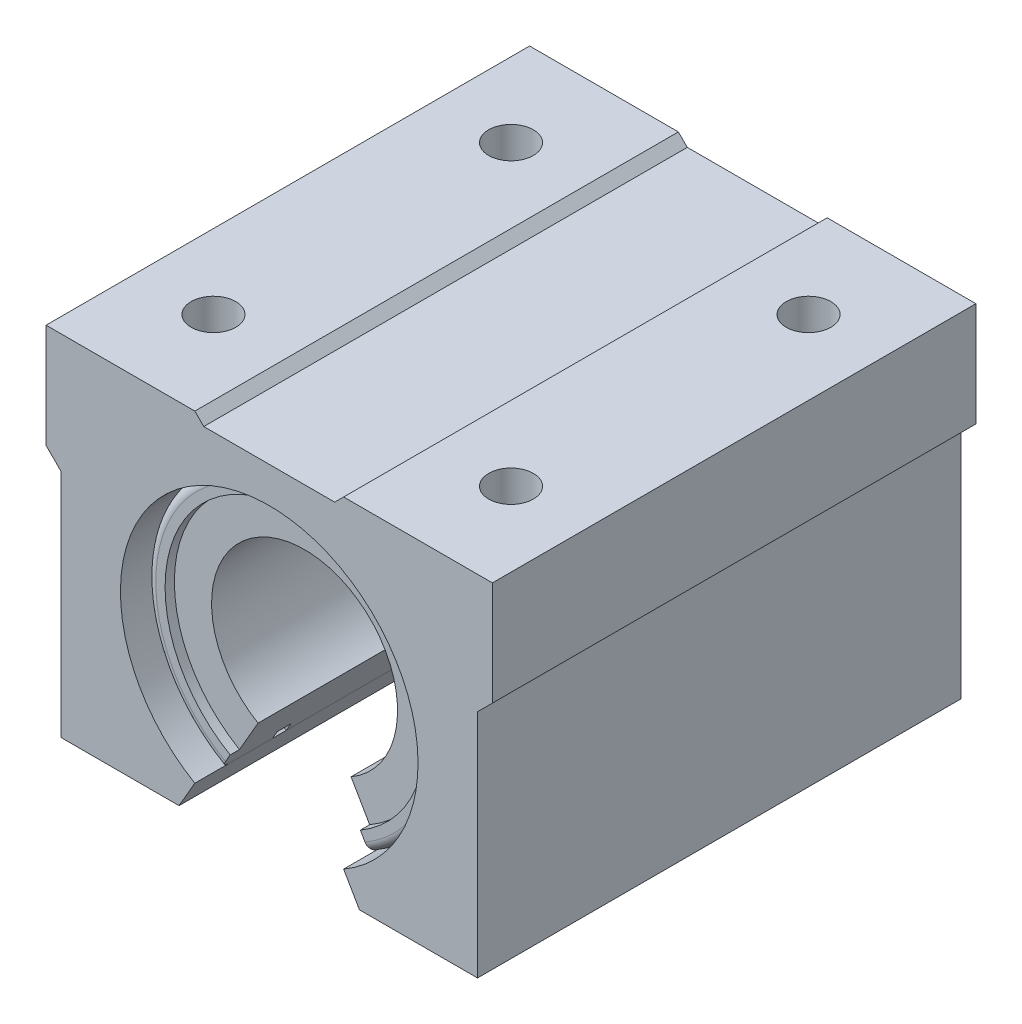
ISO-10303-21;
HEADER;
FILE_DESCRIPTION(('STEP AP214'),'2;1');
FILE_NAME('part.step','',(''),(''),'','','');
FILE_SCHEMA(('AUTOMOTIVE_DESIGN { 1 0 10303 214 1 1 1 1 }'));
ENDSEC;
DATA;
#1=APPLICATION_CONTEXT('core data for automotive mechanical design processes');
#2=APPLICATION_PROTOCOL_DEFINITION('international standard','automotive_design',2000,#1);
#3=PRODUCT_CONTEXT('',#1,'mechanical');
#4=PRODUCT('Part','Part','',(#3));
#5=PRODUCT_RELATED_PRODUCT_CATEGORY('part','',(#4));
#6=PRODUCT_DEFINITION_FORMATION('','',#4);
#7=PRODUCT_DEFINITION_CONTEXT('part definition',#1,'design');
#8=PRODUCT_DEFINITION('design','',#6,#7);
#9=PRODUCT_DEFINITION_SHAPE('','',#8);
#10=(LENGTH_UNIT() NAMED_UNIT(*) SI_UNIT(.MILLI.,.METRE.));
#11=(NAMED_UNIT(*) PLANE_ANGLE_UNIT() SI_UNIT($,.RADIAN.));
#12=(NAMED_UNIT(*) SI_UNIT($,.STERADIAN.) SOLID_ANGLE_UNIT());
#13=UNCERTAINTY_MEASURE_WITH_UNIT(LENGTH_MEASURE(1.E-05),#10,'distance_accuracy_value','');
#14=(GEOMETRIC_REPRESENTATION_CONTEXT(3) GLOBAL_UNCERTAINTY_ASSIGNED_CONTEXT((#13)) GLOBAL_UNIT_ASSIGNED_CONTEXT((#10,
#11,#12)) REPRESENTATION_CONTEXT('',''));
#15=CARTESIAN_POINT('',(0.,0.,0.));
#16=DIRECTION('',(0.,0.,1.));
#17=DIRECTION('',(1.,0.,0.));
#18=AXIS2_PLACEMENT_3D('',#15,#16,#17);
#19=CARTESIAN_POINT('',(0.,0.,29.));
#20=DIRECTION('',(0.,0.,-1.));
#21=DIRECTION('',(-1.,0.,0.));
#22=AXIS2_PLACEMENT_3D('',#19,#20,#21);
#23=CYLINDRICAL_SURFACE('',#22,12.5);
#24=DIRECTION('',(0.,0.,-1.));
#25=VECTOR('',#24,1.);
#26=CARTESIAN_POINT('',(6.25000000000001,-10.8253175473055,29.));
#27=LINE('',#26,#25);
#28=CARTESIAN_POINT('',(6.25000000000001,-10.8253175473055,27.75));
#29=VERTEX_POINT('',#28);
#30=CARTESIAN_POINT('',(6.25000000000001,-10.8253175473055,-27.75));
#31=VERTEX_POINT('',#30);
#32=EDGE_CURVE('P0_E38',#29,#31,#27,.T.);
#33=ORIENTED_EDGE('',*,*,#32,.F.);
#34=CARTESIAN_POINT('',(0.,0.,27.75));
#35=DIRECTION('',(0.,0.,1.));
#36=DIRECTION('',(1.,0.,0.));
#37=AXIS2_PLACEMENT_3D('',#34,#35,#36);
#38=CIRCLE('',#37,12.5);
#39=CARTESIAN_POINT('',(-6.25000000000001,-10.8253175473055,27.75));
#40=VERTEX_POINT('',#39);
#41=EDGE_CURVE('P0_E168',#29,#40,#38,.T.);
#42=ORIENTED_EDGE('',*,*,#41,.T.);
#43=DIRECTION('',(0.,0.,-1.));
#44=VECTOR('',#43,1.);
#45=CARTESIAN_POINT('',(-6.25000000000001,-10.8253175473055,29.));
#46=LINE('',#45,#44);
#47=CARTESIAN_POINT('',(-6.25000000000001,-10.8253175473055,-27.75));
#48=VERTEX_POINT('',#47);
#49=EDGE_CURVE('P0_E211',#48,#40,#46,.F.);
#50=ORIENTED_EDGE('',*,*,#49,.F.);
#51=CARTESIAN_POINT('',(0.,0.,-27.75));
#52=DIRECTION('',(0.,0.,-1.));
#53=DIRECTION('',(-1.,0.,0.));
#54=AXIS2_PLACEMENT_3D('',#51,#52,#53);
#55=CIRCLE('',#54,12.5);
#56=EDGE_CURVE('P0_E166',#48,#31,#55,.T.);
#57=ORIENTED_EDGE('',*,*,#56,.T.);
#58=EDGE_LOOP('',(#33,#42,#50,#57));
#59=FACE_BOUND('',#58,.T.);
#60=ADVANCED_FACE('P0_F16',(#59),#23,.F.);
#61=CARTESIAN_POINT('',(0.,0.,-29.));
#62=DIRECTION('',(0.,0.,1.));
#63=DIRECTION('',(1.,0.,0.));
#64=AXIS2_PLACEMENT_3D('',#61,#62,#63);
#65=PLANE('',#64);
#66=CARTESIAN_POINT('',(0.,0.,-29.));
#67=DIRECTION('',(0.,0.,1.));
#68=DIRECTION('',(1.,0.,0.));
#69=AXIS2_PLACEMENT_3D('',#66,#67,#68);
#70=CIRCLE('',#69,18.75);
#71=CARTESIAN_POINT('',(-9.37500000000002,-16.2379763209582,-29.));
#72=VERTEX_POINT('',#71);
#73=CARTESIAN_POINT('',(9.37500000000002,-16.2379763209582,-29.));
#74=VERTEX_POINT('',#73);
#75=EDGE_CURVE('P0_E202',#72,#74,#70,.F.);
#76=ORIENTED_EDGE('',*,*,#75,.T.);
#77=DIRECTION('',(-0.500000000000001,0.866025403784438,0.));
#78=VECTOR('',#77,1.);
#79=CARTESIAN_POINT('',(0.,0.,-29.));
#80=LINE('',#79,#78);
#81=CARTESIAN_POINT('',(8.75000000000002,-15.1554445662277,-29.));
#82=VERTEX_POINT('',#81);
#83=EDGE_CURVE('P0_E159',#74,#82,#80,.T.);
#84=ORIENTED_EDGE('',*,*,#83,.T.);
#85=CARTESIAN_POINT('',(0.,0.,-29.));
#86=DIRECTION('',(0.,0.,1.));
#87=DIRECTION('',(1.,0.,0.));
#88=AXIS2_PLACEMENT_3D('',#85,#86,#87);
#89=CIRCLE('',#88,17.5);
#90=CARTESIAN_POINT('',(-8.75000000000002,-15.1554445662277,-29.));
#91=VERTEX_POINT('',#90);
#92=EDGE_CURVE('P0_E228',#82,#91,#89,.T.);
#93=ORIENTED_EDGE('',*,*,#92,.T.);
#94=DIRECTION('',(-0.500000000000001,-0.866025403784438,0.));
#95=VECTOR('',#94,1.);
#96=CARTESIAN_POINT('',(0.,0.,-29.));
#97=LINE('',#96,#95);
#98=EDGE_CURVE('P0_E258',#91,#72,#97,.T.);
#99=ORIENTED_EDGE('',*,*,#98,.T.);
#100=EDGE_LOOP('',(#76,#84,#93,#99));
#101=FACE_BOUND('',#100,.T.);
#102=ADVANCED_FACE('P0_F257',(#101),#65,.F.);
#103=CARTESIAN_POINT('',(0.,0.,29.));
#104=DIRECTION('',(0.,0.,-1.));
#105=DIRECTION('',(-1.,0.,0.));
#106=AXIS2_PLACEMENT_3D('',#103,#104,#105);
#107=CYLINDRICAL_SURFACE('',#106,20.);
#108=CARTESIAN_POINT('',(0.,0.,20.2));
#109=DIRECTION('',(0.,0.,1.));
#110=DIRECTION('',(1.,0.,0.));
#111=AXIS2_PLACEMENT_3D('',#108,#109,#110);
#112=CIRCLE('',#111,20.);
#113=CARTESIAN_POINT('',(10.,-17.3205080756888,20.2));
#114=VERTEX_POINT('',#113);
#115=CARTESIAN_POINT('',(-10.,-17.3205080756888,20.2));
#116=VERTEX_POINT('',#115);
#117=EDGE_CURVE('P0_E187',#114,#116,#112,.T.);
#118=ORIENTED_EDGE('',*,*,#117,.F.);
#119=DIRECTION('',(0.,0.,1.));
#120=VECTOR('',#119,1.);
#121=CARTESIAN_POINT('',(10.,-17.3205080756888,-29.));
#122=LINE('',#121,#120);
#123=CARTESIAN_POINT('',(10.,-17.3205080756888,-20.2));
#124=VERTEX_POINT('',#123);
#125=EDGE_CURVE('P0_E268',#124,#114,#122,.T.);
#126=ORIENTED_EDGE('',*,*,#125,.F.);
#127=CARTESIAN_POINT('',(0.,0.,-20.2));
#128=DIRECTION('',(0.,0.,1.));
#129=DIRECTION('',(1.,0.,0.));
#130=AXIS2_PLACEMENT_3D('',#127,#128,#129);
#131=CIRCLE('',#130,20.);
#132=CARTESIAN_POINT('',(-10.,-17.3205080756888,-20.2));
#133=VERTEX_POINT('',#132);
#134=EDGE_CURVE('P0_E184',#124,#133,#131,.T.);
#135=ORIENTED_EDGE('',*,*,#134,.T.);
#136=DIRECTION('',(0.,0.,1.));
#137=VECTOR('',#136,1.);
#138=CARTESIAN_POINT('',(-10.,-17.3205080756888,-29.));
#139=LINE('',#138,#137);
#140=EDGE_CURVE('P0_E273',#133,#116,#139,.T.);
#141=ORIENTED_EDGE('',*,*,#140,.T.);
#142=EDGE_LOOP('',(#118,#126,#135,#141));
#143=FACE_BOUND('',#142,.T.);
#144=ADVANCED_FACE('P0_F325',(#143),#107,.T.);
#145=CARTESIAN_POINT('',(0.,0.,-22.05));
#146=DIRECTION('',(0.,0.,1.));
#147=DIRECTION('',(1.,0.,0.));
#148=AXIS2_PLACEMENT_3D('',#145,#146,#147);
#149=CIRCLE('',#148,20.);
#150=CARTESIAN_POINT('',(10.,-17.3205080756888,-22.05));
#151=VERTEX_POINT('',#150);
#152=CARTESIAN_POINT('',(-10.,-17.3205080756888,-22.05));
#153=VERTEX_POINT('',#152);
#154=EDGE_CURVE('P0_E181',#151,#153,#149,.T.);
#155=ORIENTED_EDGE('',*,*,#154,.F.);
#156=CARTESIAN_POINT('',(10.,-17.3205080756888,-27.75));
#157=VERTEX_POINT('',#156);
#158=EDGE_CURVE('P0_E270',#157,#151,#122,.T.);
#159=ORIENTED_EDGE('',*,*,#158,.F.);
#160=CARTESIAN_POINT('',(0.,0.,-27.75));
#161=DIRECTION('',(0.,0.,1.));
#162=DIRECTION('',(1.,0.,0.));
#163=AXIS2_PLACEMENT_3D('',#160,#161,#162);
#164=CIRCLE('',#163,20.);
#165=CARTESIAN_POINT('',(-10.,-17.3205080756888,-27.75));
#166=VERTEX_POINT('',#165);
#167=EDGE_CURVE('P0_E199',#157,#166,#164,.T.);
#168=ORIENTED_EDGE('',*,*,#167,.T.);
#169=EDGE_CURVE('P0_E269',#166,#153,#139,.T.);
#170=ORIENTED_EDGE('',*,*,#169,.T.);
#171=EDGE_LOOP('',(#155,#159,#168,#170));
#172=FACE_BOUND('',#171,.T.);
#173=ADVANCED_FACE('P0_F333',(#172),#107,.T.);
#174=CARTESIAN_POINT('',(0.,0.,27.75));
#175=DIRECTION('',(0.,0.,1.));
#176=DIRECTION('',(1.,0.,0.));
#177=AXIS2_PLACEMENT_3D('',#174,#175,#176);
#178=CIRCLE('',#177,20.);
#179=CARTESIAN_POINT('',(-10.,-17.3205080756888,27.75));
#180=VERTEX_POINT('',#179);
#181=CARTESIAN_POINT('',(10.,-17.3205080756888,27.75));
#182=VERTEX_POINT('',#181);
#183=EDGE_CURVE('P0_E206',#180,#182,#178,.F.);
#184=ORIENTED_EDGE('',*,*,#183,.T.);
#185=CARTESIAN_POINT('',(10.,-17.3205080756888,22.05));
#186=VERTEX_POINT('',#185);
#187=EDGE_CURVE('P0_E266',#186,#182,#122,.T.);
#188=ORIENTED_EDGE('',*,*,#187,.F.);
#189=CARTESIAN_POINT('',(0.,0.,22.05));
#190=DIRECTION('',(0.,0.,1.));
#191=DIRECTION('',(1.,0.,0.));
#192=AXIS2_PLACEMENT_3D('',#189,#190,#191);
#193=CIRCLE('',#192,20.);
#194=CARTESIAN_POINT('',(-10.,-17.3205080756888,22.05));
#195=VERTEX_POINT('',#194);
#196=EDGE_CURVE('P0_E196',#186,#195,#193,.T.);
#197=ORIENTED_EDGE('',*,*,#196,.T.);
#198=EDGE_CURVE('P0_E262',#195,#180,#139,.T.);
#199=ORIENTED_EDGE('',*,*,#198,.T.);
#200=EDGE_LOOP('',(#184,#188,#197,#199));
#201=FACE_BOUND('',#200,.T.);
#202=ADVANCED_FACE('P0_F305',(#201),#107,.T.);
#203=CARTESIAN_POINT('',(0.,0.,29.));
#204=DIRECTION('',(0.,0.,1.));
#205=DIRECTION('',(1.,0.,0.));
#206=AXIS2_PLACEMENT_3D('',#203,#204,#205);
#207=PLANE('',#206);
#208=DIRECTION('',(-0.500000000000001,0.866025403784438,0.));
#209=VECTOR('',#208,1.);
#210=CARTESIAN_POINT('',(0.,0.,29.));
#211=LINE('',#210,#209);
#212=CARTESIAN_POINT('',(9.37500000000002,-16.2379763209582,29.));
#213=VERTEX_POINT('',#212);
#214=CARTESIAN_POINT('',(8.75000000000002,-15.1554445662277,29.));
#215=VERTEX_POINT('',#214);
#216=EDGE_CURVE('P0_E160',#213,#215,#211,.T.);
#217=ORIENTED_EDGE('',*,*,#216,.F.);
#218=CARTESIAN_POINT('',(0.,0.,29.));
#219=DIRECTION('',(0.,0.,1.));
#220=DIRECTION('',(1.,0.,0.));
#221=AXIS2_PLACEMENT_3D('',#218,#219,#220);
#222=CIRCLE('',#221,18.75);
#223=CARTESIAN_POINT('',(-9.37500000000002,-16.2379763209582,29.));
#224=VERTEX_POINT('',#223);
#225=EDGE_CURVE('P0_E158',#213,#224,#222,.T.);
#226=ORIENTED_EDGE('',*,*,#225,.T.);
#227=DIRECTION('',(-0.500000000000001,-0.866025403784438,0.));
#228=VECTOR('',#227,1.);
#229=CARTESIAN_POINT('',(0.,0.,29.));
#230=LINE('',#229,#228);
#231=CARTESIAN_POINT('',(-8.75000000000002,-15.1554445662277,29.));
#232=VERTEX_POINT('',#231);
#233=EDGE_CURVE('P0_E141',#232,#224,#230,.T.);
#234=ORIENTED_EDGE('',*,*,#233,.F.);
#235=CARTESIAN_POINT('',(0.,0.,29.));
#236=DIRECTION('',(0.,0.,1.));
#237=DIRECTION('',(1.,0.,0.));
#238=AXIS2_PLACEMENT_3D('',#235,#236,#237);
#239=CIRCLE('',#238,17.5);
#240=EDGE_CURVE('P0_E156',#215,#232,#239,.T.);
#241=ORIENTED_EDGE('',*,*,#240,.F.);
#242=EDGE_LOOP('',(#217,#226,#234,#241));
#243=FACE_BOUND('',#242,.T.);
#244=ADVANCED_FACE('P0_F155',(#243),#207,.T.);
#245=CARTESIAN_POINT('',(-1.39659253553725E-13,-20.,22.05));
#246=DIRECTION('',(0.,0.,-1.));
#247=DIRECTION('',(-1.,0.,0.));
#248=AXIS2_PLACEMENT_3D('',#245,#246,#247);
#249=PLANE('',#248);
#250=DIRECTION('',(0.500000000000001,-0.866025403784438,0.));
#251=VECTOR('',#250,1.);
#252=CARTESIAN_POINT('',(8.66025403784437,-14.9999999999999,22.05));
#253=LINE('',#252,#251);
#254=CARTESIAN_POINT('',(9.37500000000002,-16.2379763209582,22.05));
#255=VERTEX_POINT('',#254);
#256=EDGE_CURVE('P0_E253',#255,#186,#253,.T.);
#257=ORIENTED_EDGE('',*,*,#256,.F.);
#258=CARTESIAN_POINT('',(0.,0.,22.05));
#259=DIRECTION('',(0.,0.,1.));
#260=DIRECTION('',(1.,0.,0.));
#261=AXIS2_PLACEMENT_3D('',#258,#259,#260);
#262=CIRCLE('',#261,18.75);
#263=CARTESIAN_POINT('',(-9.37500000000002,-16.2379763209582,22.05));
#264=VERTEX_POINT('',#263);
#265=EDGE_CURVE('P0_E193',#255,#264,#262,.T.);
#266=ORIENTED_EDGE('',*,*,#265,.T.);
#267=DIRECTION('',(0.500000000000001,0.866025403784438,0.));
#268=VECTOR('',#267,1.);
#269=CARTESIAN_POINT('',(-8.66025403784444,-15.,22.05));
#270=LINE('',#269,#268);
#271=EDGE_CURVE('P0_E229',#195,#264,#270,.T.);
#272=ORIENTED_EDGE('',*,*,#271,.F.);
#273=ORIENTED_EDGE('',*,*,#196,.F.);
#274=EDGE_LOOP('',(#257,#266,#272,#273));
#275=FACE_BOUND('',#274,.T.);
#276=ADVANCED_FACE('P0_F303',(#275),#249,.T.);
#277=CARTESIAN_POINT('',(0.,0.,0.));
#278=DIRECTION('',(0.,0.,1.));
#279=DIRECTION('',(1.,0.,0.));
#280=AXIS2_PLACEMENT_3D('',#277,#278,#279);
#281=CYLINDRICAL_SURFACE('',#280,18.75);
#282=DIRECTION('',(0.,0.,1.));
#283=VECTOR('',#282,1.);
#284=CARTESIAN_POINT('',(9.37500000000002,-16.2379763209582,0.));
#285=LINE('',#284,#283);
#286=CARTESIAN_POINT('',(9.37500000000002,-16.2379763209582,20.2));
#287=VERTEX_POINT('',#286);
#288=EDGE_CURVE('P0_E251',#287,#255,#285,.T.);
#289=ORIENTED_EDGE('',*,*,#288,.F.);
#290=CARTESIAN_POINT('',(0.,0.,20.2));
#291=DIRECTION('',(0.,0.,1.));
#292=DIRECTION('',(1.,0.,0.));
#293=AXIS2_PLACEMENT_3D('',#290,#291,#292);
#294=CIRCLE('',#293,18.75);
#295=CARTESIAN_POINT('',(-9.37500000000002,-16.2379763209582,20.2));
#296=VERTEX_POINT('',#295);
#297=EDGE_CURVE('P0_E190',#287,#296,#294,.T.);
#298=ORIENTED_EDGE('',*,*,#297,.T.);
#299=DIRECTION('',(0.,0.,1.));
#300=VECTOR('',#299,1.);
#301=CARTESIAN_POINT('',(-9.37500000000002,-16.2379763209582,0.));
#302=LINE('',#301,#300);
#303=EDGE_CURVE('P0_E233',#264,#296,#302,.F.);
#304=ORIENTED_EDGE('',*,*,#303,.F.);
#305=ORIENTED_EDGE('',*,*,#265,.F.);
#306=EDGE_LOOP('',(#289,#298,#304,#305));
#307=FACE_BOUND('',#306,.T.);
#308=ADVANCED_FACE('P0_F298',(#307),#281,.T.);
#309=CARTESIAN_POINT('',(-1.30930550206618E-13,-18.75,20.2));
#310=DIRECTION('',(0.,0.,1.));
#311=DIRECTION('',(1.,0.,0.));
#312=AXIS2_PLACEMENT_3D('',#309,#310,#311);
#313=PLANE('',#312);
#314=DIRECTION('',(-0.500000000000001,0.866025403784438,0.));
#315=VECTOR('',#314,1.);
#316=CARTESIAN_POINT('',(8.11898816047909,-14.0624999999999,20.2));
#317=LINE('',#316,#315);
#318=EDGE_CURVE('P0_E249',#114,#287,#317,.T.);
#319=ORIENTED_EDGE('',*,*,#318,.F.);
#320=ORIENTED_EDGE('',*,*,#117,.T.);
#321=DIRECTION('',(-0.500000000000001,-0.866025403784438,0.));
#322=VECTOR('',#321,1.);
#323=CARTESIAN_POINT('',(-8.11898816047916,-14.0625,20.2));
#324=LINE('',#323,#322);
#325=EDGE_CURVE('P0_E285',#296,#116,#324,.T.);
#326=ORIENTED_EDGE('',*,*,#325,.F.);
#327=ORIENTED_EDGE('',*,*,#297,.F.);
#328=EDGE_LOOP('',(#319,#320,#326,#327));
#329=FACE_BOUND('',#328,.T.);
#330=ADVANCED_FACE('P0_F295',(#329),#313,.T.);
#331=CARTESIAN_POINT('',(-1.30930550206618E-13,-18.75,-20.2));
#332=DIRECTION('',(0.,0.,-1.));
#333=DIRECTION('',(-1.,0.,0.));
#334=AXIS2_PLACEMENT_3D('',#331,#332,#333);
#335=PLANE('',#334);
#336=DIRECTION('',(0.500000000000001,-0.866025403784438,0.));
#337=VECTOR('',#336,1.);
#338=CARTESIAN_POINT('',(8.11898816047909,-14.0624999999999,-20.2));
#339=LINE('',#338,#337);
#340=CARTESIAN_POINT('',(9.37500000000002,-16.2379763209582,-20.2));
#341=VERTEX_POINT('',#340);
#342=EDGE_CURVE('P0_E247',#341,#124,#339,.T.);
#343=ORIENTED_EDGE('',*,*,#342,.F.);
#344=CARTESIAN_POINT('',(0.,0.,-20.2));
#345=DIRECTION('',(0.,0.,1.));
#346=DIRECTION('',(1.,0.,0.));
#347=AXIS2_PLACEMENT_3D('',#344,#345,#346);
#348=CIRCLE('',#347,18.75);
#349=CARTESIAN_POINT('',(-9.37500000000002,-16.2379763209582,-20.2));
#350=VERTEX_POINT('',#349);
#351=EDGE_CURVE('P0_E175',#341,#350,#348,.T.);
#352=ORIENTED_EDGE('',*,*,#351,.T.);
#353=DIRECTION('',(0.500000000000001,0.866025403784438,0.));
#354=VECTOR('',#353,1.);
#355=CARTESIAN_POINT('',(-8.11898816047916,-14.0625,-20.2));
#356=LINE('',#355,#354);
#357=EDGE_CURVE('P0_E283',#133,#350,#356,.T.);
#358=ORIENTED_EDGE('',*,*,#357,.F.);
#359=ORIENTED_EDGE('',*,*,#134,.F.);
#360=EDGE_LOOP('',(#343,#352,#358,#359));
#361=FACE_BOUND('',#360,.T.);
#362=ADVANCED_FACE('P0_F361',(#361),#335,.T.);
#363=CARTESIAN_POINT('',(-1.39659253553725E-13,-20.,-22.05));
#364=DIRECTION('',(0.,0.,1.));
#365=DIRECTION('',(1.,0.,0.));
#366=AXIS2_PLACEMENT_3D('',#363,#364,#365);
#367=PLANE('',#366);
#368=DIRECTION('',(-0.500000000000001,0.866025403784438,0.));
#369=VECTOR('',#368,1.);
#370=CARTESIAN_POINT('',(8.66025403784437,-14.9999999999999,-22.05));
#371=LINE('',#370,#369);
#372=CARTESIAN_POINT('',(9.37500000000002,-16.2379763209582,-22.05));
#373=VERTEX_POINT('',#372);
#374=EDGE_CURVE('P0_E245',#151,#373,#371,.T.);
#375=ORIENTED_EDGE('',*,*,#374,.F.);
#376=ORIENTED_EDGE('',*,*,#154,.T.);
#377=DIRECTION('',(-0.500000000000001,-0.866025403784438,0.));
#378=VECTOR('',#377,1.);
#379=CARTESIAN_POINT('',(-8.66025403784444,-15.,-22.05));
#380=LINE('',#379,#378);
#381=CARTESIAN_POINT('',(-9.37500000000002,-16.2379763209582,-22.05));
#382=VERTEX_POINT('',#381);
#383=EDGE_CURVE('P0_E281',#382,#153,#380,.T.);
#384=ORIENTED_EDGE('',*,*,#383,.F.);
#385=CARTESIAN_POINT('',(0.,0.,-22.05));
#386=DIRECTION('',(0.,0.,1.));
#387=DIRECTION('',(1.,0.,0.));
#388=AXIS2_PLACEMENT_3D('',#385,#386,#387);
#389=CIRCLE('',#388,18.75);
#390=EDGE_CURVE('P0_E178',#373,#382,#389,.T.);
#391=ORIENTED_EDGE('',*,*,#390,.F.);
#392=EDGE_LOOP('',(#375,#376,#384,#391));
#393=FACE_BOUND('',#392,.T.);
#394=ADVANCED_FACE('P0_F353',(#393),#367,.T.);
#395=CARTESIAN_POINT('',(0.,0.,0.));
#396=DIRECTION('',(0.,0.,1.));
#397=DIRECTION('',(1.,0.,0.));
#398=AXIS2_PLACEMENT_3D('',#395,#396,#397);
#399=CYLINDRICAL_SURFACE('',#398,18.75);
#400=DIRECTION('',(0.,0.,1.));
#401=VECTOR('',#400,1.);
#402=CARTESIAN_POINT('',(9.37500000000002,-16.2379763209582,0.));
#403=LINE('',#402,#401);
#404=EDGE_CURVE('P0_E243',#373,#341,#403,.T.);
#405=ORIENTED_EDGE('',*,*,#404,.F.);
#406=ORIENTED_EDGE('',*,*,#390,.T.);
#407=DIRECTION('',(0.,0.,1.));
#408=VECTOR('',#407,1.);
#409=CARTESIAN_POINT('',(-9.37500000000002,-16.2379763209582,0.));
#410=LINE('',#409,#408);
#411=EDGE_CURVE('P0_E279',#350,#382,#410,.F.);
#412=ORIENTED_EDGE('',*,*,#411,.F.);
#413=ORIENTED_EDGE('',*,*,#351,.F.);
#414=EDGE_LOOP('',(#405,#406,#412,#413));
#415=FACE_BOUND('',#414,.T.);
#416=ADVANCED_FACE('P0_F318',(#415),#399,.T.);
#417=CARTESIAN_POINT('',(0.,0.,-27.75));
#418=DIRECTION('',(0.,0.,1.));
#419=DIRECTION('',(1.,0.,0.));
#420=AXIS2_PLACEMENT_3D('',#417,#418,#419);
#421=TOROIDAL_SURFACE('',#420,18.75,1.25);
#422=CARTESIAN_POINT('',(9.37500000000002,-16.2379763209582,-27.75));
#423=DIRECTION('',(0.866025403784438,0.500000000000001,0.));
#424=DIRECTION('',(-0.500000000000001,0.866025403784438,0.));
#425=AXIS2_PLACEMENT_3D('',#422,#423,#424);
#426=CIRCLE('',#425,1.25);
#427=EDGE_CURVE('P0_E241',#74,#157,#426,.F.);
#428=ORIENTED_EDGE('',*,*,#427,.F.);
#429=ORIENTED_EDGE('',*,*,#75,.F.);
#430=CARTESIAN_POINT('',(-9.37500000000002,-16.2379763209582,-27.75));
#431=DIRECTION('',(-0.866025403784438,0.500000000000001,0.));
#432=DIRECTION('',(-0.500000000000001,-0.866025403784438,0.));
#433=AXIS2_PLACEMENT_3D('',#430,#431,#432);
#434=CIRCLE('',#433,1.25);
#435=EDGE_CURVE('P0_E277',#166,#72,#434,.F.);
#436=ORIENTED_EDGE('',*,*,#435,.F.);
#437=ORIENTED_EDGE('',*,*,#167,.F.);
#438=EDGE_LOOP('',(#428,#429,#436,#437));
#439=FACE_BOUND('',#438,.T.);
#440=ADVANCED_FACE('P0_F310',(#439),#421,.T.);
#441=CARTESIAN_POINT('',(0.,0.,27.75));
#442=DIRECTION('',(0.,0.,1.));
#443=DIRECTION('',(1.,0.,0.));
#444=AXIS2_PLACEMENT_3D('',#441,#442,#443);
#445=TOROIDAL_SURFACE('',#444,18.75,1.25);
#446=CARTESIAN_POINT('',(9.37500000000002,-16.2379763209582,27.75));
#447=DIRECTION('',(0.866025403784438,0.500000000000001,0.));
#448=DIRECTION('',(-0.500000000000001,0.866025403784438,0.));
#449=AXIS2_PLACEMENT_3D('',#446,#447,#448);
#450=CIRCLE('',#449,1.25);
#451=EDGE_CURVE('P0_E239',#182,#213,#450,.F.);
#452=ORIENTED_EDGE('',*,*,#451,.F.);
#453=ORIENTED_EDGE('',*,*,#183,.F.);
#454=CARTESIAN_POINT('',(-9.37500000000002,-16.2379763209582,27.75));
#455=DIRECTION('',(-0.866025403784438,0.500000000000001,0.));
#456=DIRECTION('',(-0.500000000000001,-0.866025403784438,0.));
#457=AXIS2_PLACEMENT_3D('',#454,#455,#456);
#458=CIRCLE('',#457,1.25);
#459=EDGE_CURVE('P0_E149',#224,#180,#458,.F.);
#460=ORIENTED_EDGE('',*,*,#459,.F.);
#461=ORIENTED_EDGE('',*,*,#225,.F.);
#462=EDGE_LOOP('',(#452,#453,#460,#461));
#463=FACE_BOUND('',#462,.T.);
#464=ADVANCED_FACE('P0_F18',(#463),#445,.T.);
#465=CARTESIAN_POINT('',(0.,0.,27.75));
#466=DIRECTION('',(0.,0.,1.));
#467=DIRECTION('',(1.,0.,0.));
#468=AXIS2_PLACEMENT_3D('',#465,#466,#467);
#469=CYLINDRICAL_SURFACE('',#468,17.5);
#470=CARTESIAN_POINT('',(0.,0.,27.75));
#471=DIRECTION('',(0.,0.,1.));
#472=DIRECTION('',(1.,0.,0.));
#473=AXIS2_PLACEMENT_3D('',#470,#471,#472);
#474=CIRCLE('',#473,17.5);
#475=CARTESIAN_POINT('',(8.75000000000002,-15.1554445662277,27.75));
#476=VERTEX_POINT('',#475);
#477=CARTESIAN_POINT('',(-8.75000000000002,-15.1554445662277,27.75));
#478=VERTEX_POINT('',#477);
#479=EDGE_CURVE('P0_E165',#476,#478,#474,.T.);
#480=ORIENTED_EDGE('',*,*,#479,.F.);
#481=DIRECTION('',(0.,0.,1.));
#482=VECTOR('',#481,1.);
#483=CARTESIAN_POINT('',(8.75000000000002,-15.1554445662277,27.75));
#484=LINE('',#483,#482);
#485=EDGE_CURVE('P0_E164',#476,#215,#484,.T.);
#486=ORIENTED_EDGE('',*,*,#485,.T.);
#487=ORIENTED_EDGE('',*,*,#240,.T.);
#488=DIRECTION('',(0.,0.,1.));
#489=VECTOR('',#488,1.);
#490=CARTESIAN_POINT('',(-8.75000000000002,-15.1554445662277,27.75));
#491=LINE('',#490,#489);
#492=EDGE_CURVE('P0_E138',#232,#478,#491,.F.);
#493=ORIENTED_EDGE('',*,*,#492,.T.);
#494=EDGE_LOOP('',(#480,#486,#487,#493));
#495=FACE_BOUND('',#494,.T.);
#496=ADVANCED_FACE('P0_F163',(#495),#469,.F.);
#497=CARTESIAN_POINT('',(0.,0.,27.75));
#498=DIRECTION('',(0.,0.,1.));
#499=DIRECTION('',(1.,0.,0.));
#500=AXIS2_PLACEMENT_3D('',#497,#498,#499);
#501=PLANE('',#500);
#502=DIRECTION('',(-0.500000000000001,0.866025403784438,0.));
#503=VECTOR('',#502,1.);
#504=CARTESIAN_POINT('',(0.,0.,27.75));
#505=LINE('',#504,#503);
#506=EDGE_CURVE('P0_E231',#476,#29,#505,.T.);
#507=ORIENTED_EDGE('',*,*,#506,.F.);
#508=ORIENTED_EDGE('',*,*,#479,.T.);
#509=DIRECTION('',(-0.500000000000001,-0.866025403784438,0.));
#510=VECTOR('',#509,1.);
#511=CARTESIAN_POINT('',(0.,0.,27.75));
#512=LINE('',#511,#510);
#513=EDGE_CURVE('P0_E144',#40,#478,#512,.T.);
#514=ORIENTED_EDGE('',*,*,#513,.F.);
#515=ORIENTED_EDGE('',*,*,#41,.F.);
#516=EDGE_LOOP('',(#507,#508,#514,#515));
#517=FACE_BOUND('',#516,.T.);
#518=ADVANCED_FACE('P0_F316',(#517),#501,.T.);
#519=CARTESIAN_POINT('',(0.,0.,-27.75));
#520=DIRECTION('',(0.,0.,-1.));
#521=DIRECTION('',(-1.,0.,0.));
#522=AXIS2_PLACEMENT_3D('',#519,#520,#521);
#523=CYLINDRICAL_SURFACE('',#522,17.5);
#524=DIRECTION('',(0.,0.,-1.));
#525=VECTOR('',#524,1.);
#526=CARTESIAN_POINT('',(8.75000000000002,-15.1554445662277,-27.75));
#527=LINE('',#526,#525);
#528=CARTESIAN_POINT('',(8.75000000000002,-15.1554445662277,-27.75));
#529=VERTEX_POINT('',#528);
#530=EDGE_CURVE('P0_E222',#529,#82,#527,.T.);
#531=ORIENTED_EDGE('',*,*,#530,.F.);
#532=CARTESIAN_POINT('',(0.,0.,-27.75));
#533=DIRECTION('',(0.,0.,1.));
#534=DIRECTION('',(1.,0.,0.));
#535=AXIS2_PLACEMENT_3D('',#532,#533,#534);
#536=CIRCLE('',#535,17.5);
#537=CARTESIAN_POINT('',(-8.75000000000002,-15.1554445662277,-27.75));
#538=VERTEX_POINT('',#537);
#539=EDGE_CURVE('P0_E171',#529,#538,#536,.T.);
#540=ORIENTED_EDGE('',*,*,#539,.T.);
#541=DIRECTION('',(0.,0.,-1.));
#542=VECTOR('',#541,1.);
#543=CARTESIAN_POINT('',(-8.75000000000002,-15.1554445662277,-27.75));
#544=LINE('',#543,#542);
#545=EDGE_CURVE('P0_E31',#91,#538,#544,.F.);
#546=ORIENTED_EDGE('',*,*,#545,.F.);
#547=ORIENTED_EDGE('',*,*,#92,.F.);
#548=EDGE_LOOP('',(#531,#540,#546,#547));
#549=FACE_BOUND('',#548,.T.);
#550=ADVANCED_FACE('P0_F226',(#549),#523,.F.);
#551=CARTESIAN_POINT('',(0.,0.,-27.75));
#552=DIRECTION('',(0.,0.,-1.));
#553=DIRECTION('',(1.,0.,0.));
#554=AXIS2_PLACEMENT_3D('',#551,#552,#553);
#555=PLANE('',#554);
#556=DIRECTION('',(0.500000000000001,-0.866025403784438,0.));
#557=VECTOR('',#556,1.);
#558=CARTESIAN_POINT('',(0.,0.,-27.75));
#559=LINE('',#558,#557);
#560=EDGE_CURVE('P0_E11',#31,#529,#559,.T.);
#561=ORIENTED_EDGE('',*,*,#560,.F.);
#562=ORIENTED_EDGE('',*,*,#56,.F.);
#563=DIRECTION('',(0.500000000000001,0.866025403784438,0.));
#564=VECTOR('',#563,1.);
#565=CARTESIAN_POINT('',(0.,0.,-27.75));
#566=LINE('',#565,#564);
#567=EDGE_CURVE('P0_E24',#538,#48,#566,.T.);
#568=ORIENTED_EDGE('',*,*,#567,.F.);
#569=ORIENTED_EDGE('',*,*,#539,.F.);
#570=EDGE_LOOP('',(#561,#562,#568,#569));
#571=FACE_BOUND('',#570,.T.);
#572=ADVANCED_FACE('P0_F219',(#571),#555,.T.);
#573=CARTESIAN_POINT('',(0.,0.,-29.));
#574=DIRECTION('',(-0.866025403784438,0.500000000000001,0.));
#575=DIRECTION('',(-0.500000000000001,-0.866025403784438,0.));
#576=AXIS2_PLACEMENT_3D('',#573,#574,#575);
#577=PLANE('',#576);
#578=ORIENTED_EDGE('',*,*,#271,.T.);
#579=ORIENTED_EDGE('',*,*,#303,.T.);
#580=ORIENTED_EDGE('',*,*,#325,.T.);
#581=ORIENTED_EDGE('',*,*,#140,.F.);
#582=ORIENTED_EDGE('',*,*,#357,.T.);
#583=ORIENTED_EDGE('',*,*,#411,.T.);
#584=ORIENTED_EDGE('',*,*,#383,.T.);
#585=ORIENTED_EDGE('',*,*,#169,.F.);
#586=ORIENTED_EDGE('',*,*,#435,.T.);
#587=ORIENTED_EDGE('',*,*,#98,.F.);
#588=ORIENTED_EDGE('',*,*,#545,.T.);
#589=ORIENTED_EDGE('',*,*,#567,.T.);
#590=ORIENTED_EDGE('',*,*,#49,.T.);
#591=ORIENTED_EDGE('',*,*,#513,.T.);
#592=ORIENTED_EDGE('',*,*,#492,.F.);
#593=ORIENTED_EDGE('',*,*,#233,.T.);
#594=ORIENTED_EDGE('',*,*,#459,.T.);
#595=ORIENTED_EDGE('',*,*,#198,.F.);
#596=EDGE_LOOP('',(#578,#579,#580,#581,#582,#583,#584,#585,#586,#587,#588,#589,#590,#591,#592,
#593,#594,#595));
#597=FACE_BOUND('',#596,.T.);
#598=ADVANCED_FACE('P0_F140',(#597),#577,.F.);
#599=CARTESIAN_POINT('',(0.,0.,-29.));
#600=DIRECTION('',(0.866025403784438,0.500000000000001,0.));
#601=DIRECTION('',(-0.500000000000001,0.866025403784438,0.));
#602=AXIS2_PLACEMENT_3D('',#599,#600,#601);
#603=PLANE('',#602);
#604=ORIENTED_EDGE('',*,*,#256,.T.);
#605=ORIENTED_EDGE('',*,*,#187,.T.);
#606=ORIENTED_EDGE('',*,*,#451,.T.);
#607=ORIENTED_EDGE('',*,*,#216,.T.);
#608=ORIENTED_EDGE('',*,*,#485,.F.);
#609=ORIENTED_EDGE('',*,*,#506,.T.);
#610=ORIENTED_EDGE('',*,*,#32,.T.);
#611=ORIENTED_EDGE('',*,*,#560,.T.);
#612=ORIENTED_EDGE('',*,*,#530,.T.);
#613=ORIENTED_EDGE('',*,*,#83,.F.);
#614=ORIENTED_EDGE('',*,*,#427,.T.);
#615=ORIENTED_EDGE('',*,*,#158,.T.);
#616=ORIENTED_EDGE('',*,*,#374,.T.);
#617=ORIENTED_EDGE('',*,*,#404,.T.);
#618=ORIENTED_EDGE('',*,*,#342,.T.);
#619=ORIENTED_EDGE('',*,*,#125,.T.);
#620=ORIENTED_EDGE('',*,*,#318,.T.);
#621=ORIENTED_EDGE('',*,*,#288,.T.);
#622=EDGE_LOOP('',(#604,#605,#606,#607,#608,#609,#610,#611,#612,#613,#614,#615,#616,#617,#618,
#619,#620,#621));
#623=FACE_BOUND('',#622,.T.);
#624=ADVANCED_FACE('P0_F221',(#623),#603,.F.);
#625=CLOSED_SHELL('',(#60,#102,#144,#173,#202,#244,#276,#308,#330,#362,#394,#416,#440,#464,#496,
#518,#550,#572,#598,#624));
#626=MANIFOLD_SOLID_BREP('P0_B1',#625);
#627=CARTESIAN_POINT('',(30.,26.,-32.5));
#628=DIRECTION('',(0.,1.,0.));
#629=DIRECTION('',(-1.,0.,0.));
#630=AXIS2_PLACEMENT_3D('',#627,#628,#629);
#631=PLANE('',#630);
#632=CARTESIAN_POINT('',(-20.,26.,-20.));
#633=DIRECTION('',(0.,1.,0.));
#634=DIRECTION('',(-1.,0.,0.));
#635=AXIS2_PLACEMENT_3D('',#632,#633,#634);
#636=CIRCLE('',#635,3.);
#637=CARTESIAN_POINT('',(-23.,26.,-20.));
#638=VERTEX_POINT('',#637);
#639=EDGE_CURVE('P1_E329',#638,#638,#636,.T.);
#640=ORIENTED_EDGE('',*,*,#639,.F.);
#641=EDGE_LOOP('',(#640));
#642=FACE_BOUND('',#641,.T.);
#643=DIRECTION('',(0.,0.,1.));
#644=VECTOR('',#643,1.);
#645=CARTESIAN_POINT('',(-10.,26.,-32.5));
#646=LINE('',#645,#644);
#647=CARTESIAN_POINT('',(-10.,26.,-32.5));
#648=VERTEX_POINT('',#647);
#649=CARTESIAN_POINT('',(-10.,26.,32.5));
#650=VERTEX_POINT('',#649);
#651=EDGE_CURVE('P1_E261',#648,#650,#646,.T.);
#652=ORIENTED_EDGE('',*,*,#651,.F.);
#653=DIRECTION('',(-1.,0.,0.));
#654=VECTOR('',#653,1.);
#655=CARTESIAN_POINT('',(30.,26.,-32.5));
#656=LINE('',#655,#654);
#657=CARTESIAN_POINT('',(-30.,26.,-32.5));
#658=VERTEX_POINT('',#657);
#659=EDGE_CURVE('P1_E276',#648,#658,#656,.T.);
#660=ORIENTED_EDGE('',*,*,#659,.T.);
#661=DIRECTION('',(0.,0.,1.));
#662=VECTOR('',#661,1.);
#663=CARTESIAN_POINT('',(-30.,26.,-32.5));
#664=LINE('',#663,#662);
#665=CARTESIAN_POINT('',(-30.,26.,32.5));
#666=VERTEX_POINT('',#665);
#667=EDGE_CURVE('P1_E190',#658,#666,#664,.T.);
#668=ORIENTED_EDGE('',*,*,#667,.T.);
#669=DIRECTION('',(-1.,0.,0.));
#670=VECTOR('',#669,1.);
#671=CARTESIAN_POINT('',(30.,26.,32.5));
#672=LINE('',#671,#670);
#673=EDGE_CURVE('P1_E169',#650,#666,#672,.T.);
#674=ORIENTED_EDGE('',*,*,#673,.F.);
#675=EDGE_LOOP('',(#652,#660,#668,#674));
#676=FACE_BOUND('',#675,.T.);
#677=CARTESIAN_POINT('',(-20.,26.,20.));
#678=DIRECTION('',(0.,1.,0.));
#679=DIRECTION('',(-1.,0.,0.));
#680=AXIS2_PLACEMENT_3D('',#677,#678,#679);
#681=CIRCLE('',#680,3.);
#682=CARTESIAN_POINT('',(-23.,26.,20.));
#683=VERTEX_POINT('',#682);
#684=EDGE_CURVE('P1_E292',#683,#683,#681,.T.);
#685=ORIENTED_EDGE('',*,*,#684,.F.);
#686=EDGE_LOOP('',(#685));
#687=FACE_BOUND('',#686,.T.);
#688=ADVANCED_FACE('P1_F15',(#642,#676,#687),#631,.T.);
#689=CARTESIAN_POINT('',(0.,0.,-32.5));
#690=DIRECTION('',(0.,0.,1.));
#691=DIRECTION('',(1.,0.,0.));
#692=AXIS2_PLACEMENT_3D('',#689,#690,#691);
#693=CYLINDRICAL_SURFACE('',#692,20.);
#694=CARTESIAN_POINT('',(0.,0.,32.5));
#695=DIRECTION('',(0.,0.,-1.));
#696=DIRECTION('',(1.,0.,0.));
#697=AXIS2_PLACEMENT_3D('',#694,#695,#696);
#698=CIRCLE('',#697,20.);
#699=CARTESIAN_POINT('',(-10.,-17.3205080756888,32.5));
#700=VERTEX_POINT('',#699);
#701=CARTESIAN_POINT('',(10.,-17.3205080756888,32.5));
#702=VERTEX_POINT('',#701);
#703=EDGE_CURVE('P1_E150',#700,#702,#698,.T.);
#704=ORIENTED_EDGE('',*,*,#703,.F.);
#705=DIRECTION('',(0.,0.,1.));
#706=VECTOR('',#705,1.);
#707=CARTESIAN_POINT('',(-10.,-17.3205080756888,-32.5));
#708=LINE('',#707,#706);
#709=CARTESIAN_POINT('',(-10.,-17.3205080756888,-32.5));
#710=VERTEX_POINT('',#709);
#711=EDGE_CURVE('P1_E10',#710,#700,#708,.T.);
#712=ORIENTED_EDGE('',*,*,#711,.F.);
#713=CARTESIAN_POINT('',(0.,0.,-32.5));
#714=DIRECTION('',(0.,0.,-1.));
#715=DIRECTION('',(1.,0.,0.));
#716=AXIS2_PLACEMENT_3D('',#713,#714,#715);
#717=CIRCLE('',#716,20.);
#718=CARTESIAN_POINT('',(10.,-17.3205080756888,-32.5));
#719=VERTEX_POINT('',#718);
#720=EDGE_CURVE('P1_E184',#710,#719,#717,.T.);
#721=ORIENTED_EDGE('',*,*,#720,.T.);
#722=DIRECTION('',(0.,0.,1.));
#723=VECTOR('',#722,1.);
#724=CARTESIAN_POINT('',(10.,-17.3205080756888,-32.5));
#725=LINE('',#724,#723);
#726=EDGE_CURVE('P1_E19',#719,#702,#725,.T.);
#727=ORIENTED_EDGE('',*,*,#726,.T.);
#728=EDGE_LOOP('',(#704,#712,#721,#727));
#729=FACE_BOUND('',#728,.T.);
#730=ADVANCED_FACE('P1_F17',(#729),#693,.F.);
#731=CARTESIAN_POINT('',(-10.,-17.3205080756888,-32.5));
#732=DIRECTION('',(0.866025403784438,-0.500000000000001,0.));
#733=DIRECTION('',(0.500000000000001,0.866025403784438,0.));
#734=AXIS2_PLACEMENT_3D('',#731,#732,#733);
#735=PLANE('',#734);
#736=DIRECTION('',(0.500000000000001,0.866025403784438,0.));
#737=VECTOR('',#736,1.);
#738=CARTESIAN_POINT('',(-10.,-17.3205080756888,32.5));
#739=LINE('',#738,#737);
#740=CARTESIAN_POINT('',(-12.1243556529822,-21.,32.5));
#741=VERTEX_POINT('',#740);
#742=EDGE_CURVE('P1_E182',#741,#700,#739,.T.);
#743=ORIENTED_EDGE('',*,*,#742,.F.);
#744=DIRECTION('',(0.,0.,1.));
#745=VECTOR('',#744,1.);
#746=CARTESIAN_POINT('',(-12.1243556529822,-21.,-32.5));
#747=LINE('',#746,#745);
#748=CARTESIAN_POINT('',(-12.1243556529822,-21.,-32.5));
#749=VERTEX_POINT('',#748);
#750=EDGE_CURVE('P1_E24',#749,#741,#747,.T.);
#751=ORIENTED_EDGE('',*,*,#750,.F.);
#752=DIRECTION('',(0.500000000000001,0.866025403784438,0.));
#753=VECTOR('',#752,1.);
#754=CARTESIAN_POINT('',(-10.,-17.3205080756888,-32.5));
#755=LINE('',#754,#753);
#756=EDGE_CURVE('P1_E140',#749,#710,#755,.T.);
#757=ORIENTED_EDGE('',*,*,#756,.T.);
#758=ORIENTED_EDGE('',*,*,#711,.T.);
#759=EDGE_LOOP('',(#743,#751,#757,#758));
#760=FACE_BOUND('',#759,.T.);
#761=ADVANCED_FACE('P1_F205',(#760),#735,.T.);
#762=CARTESIAN_POINT('',(-28.,-21.,-32.5));
#763=DIRECTION('',(0.,-1.,0.));
#764=DIRECTION('',(1.,0.,0.));
#765=AXIS2_PLACEMENT_3D('',#762,#763,#764);
#766=PLANE('',#765);
#767=DIRECTION('',(1.,0.,0.));
#768=VECTOR('',#767,1.);
#769=CARTESIAN_POINT('',(-28.,-21.,32.5));
#770=LINE('',#769,#768);
#771=CARTESIAN_POINT('',(-28.,-21.,32.5));
#772=VERTEX_POINT('',#771);
#773=EDGE_CURVE('P1_E126',#772,#741,#770,.T.);
#774=ORIENTED_EDGE('',*,*,#773,.F.);
#775=DIRECTION('',(0.,0.,1.));
#776=VECTOR('',#775,1.);
#777=CARTESIAN_POINT('',(-28.,-21.,-32.5));
#778=LINE('',#777,#776);
#779=CARTESIAN_POINT('',(-28.,-21.,-32.5));
#780=VERTEX_POINT('',#779);
#781=EDGE_CURVE('P1_E120',#780,#772,#778,.T.);
#782=ORIENTED_EDGE('',*,*,#781,.F.);
#783=DIRECTION('',(1.,0.,0.));
#784=VECTOR('',#783,1.);
#785=CARTESIAN_POINT('',(-28.,-21.,-32.5));
#786=LINE('',#785,#784);
#787=EDGE_CURVE('P1_E123',#780,#749,#786,.T.);
#788=ORIENTED_EDGE('',*,*,#787,.T.);
#789=ORIENTED_EDGE('',*,*,#750,.T.);
#790=EDGE_LOOP('',(#774,#782,#788,#789));
#791=FACE_BOUND('',#790,.T.);
#792=ADVANCED_FACE('P1_F122',(#791),#766,.T.);
#793=CARTESIAN_POINT('',(-28.,10.,-32.5));
#794=DIRECTION('',(-1.,0.,0.));
#795=DIRECTION('',(0.,-1.,0.));
#796=AXIS2_PLACEMENT_3D('',#793,#794,#795);
#797=PLANE('',#796);
#798=DIRECTION('',(0.,-1.,0.));
#799=VECTOR('',#798,1.);
#800=CARTESIAN_POINT('',(-28.,10.,32.5));
#801=LINE('',#800,#799);
#802=CARTESIAN_POINT('',(-28.,10.,32.5));
#803=VERTEX_POINT('',#802);
#804=EDGE_CURVE('P1_E179',#803,#772,#801,.T.);
#805=ORIENTED_EDGE('',*,*,#804,.F.);
#806=DIRECTION('',(0.,0.,1.));
#807=VECTOR('',#806,1.);
#808=CARTESIAN_POINT('',(-28.,10.,-32.5));
#809=LINE('',#808,#807);
#810=CARTESIAN_POINT('',(-28.,10.,-32.5));
#811=VERTEX_POINT('',#810);
#812=EDGE_CURVE('P1_E131',#811,#803,#809,.T.);
#813=ORIENTED_EDGE('',*,*,#812,.F.);
#814=DIRECTION('',(0.,-1.,0.));
#815=VECTOR('',#814,1.);
#816=CARTESIAN_POINT('',(-28.,10.,-32.5));
#817=LINE('',#816,#815);
#818=EDGE_CURVE('P1_E138',#811,#780,#817,.T.);
#819=ORIENTED_EDGE('',*,*,#818,.T.);
#820=ORIENTED_EDGE('',*,*,#781,.T.);
#821=EDGE_LOOP('',(#805,#813,#819,#820));
#822=FACE_BOUND('',#821,.T.);
#823=ADVANCED_FACE('P1_F142',(#822),#797,.T.);
#824=CARTESIAN_POINT('',(-30.,12.,-32.5));
#825=DIRECTION('',(-0.707106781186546,-0.707106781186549,0.));
#826=DIRECTION('',(0.707106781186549,-0.707106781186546,0.));
#827=AXIS2_PLACEMENT_3D('',#824,#825,#826);
#828=PLANE('',#827);
#829=DIRECTION('',(0.707106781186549,-0.707106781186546,0.));
#830=VECTOR('',#829,1.);
#831=CARTESIAN_POINT('',(-30.,12.,32.5));
#832=LINE('',#831,#830);
#833=CARTESIAN_POINT('',(-30.,12.,32.5));
#834=VERTEX_POINT('',#833);
#835=EDGE_CURVE('P1_E176',#834,#803,#832,.T.);
#836=ORIENTED_EDGE('',*,*,#835,.F.);
#837=DIRECTION('',(0.,0.,1.));
#838=VECTOR('',#837,1.);
#839=CARTESIAN_POINT('',(-30.,12.,-32.5));
#840=LINE('',#839,#838);
#841=CARTESIAN_POINT('',(-30.,12.,-32.5));
#842=VERTEX_POINT('',#841);
#843=EDGE_CURVE('P1_E188',#842,#834,#840,.T.);
#844=ORIENTED_EDGE('',*,*,#843,.F.);
#845=DIRECTION('',(0.707106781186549,-0.707106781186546,0.));
#846=VECTOR('',#845,1.);
#847=CARTESIAN_POINT('',(-30.,12.,-32.5));
#848=LINE('',#847,#846);
#849=EDGE_CURVE('P1_E143',#842,#811,#848,.T.);
#850=ORIENTED_EDGE('',*,*,#849,.T.);
#851=ORIENTED_EDGE('',*,*,#812,.T.);
#852=EDGE_LOOP('',(#836,#844,#850,#851));
#853=FACE_BOUND('',#852,.T.);
#854=ADVANCED_FACE('P1_F235',(#853),#828,.T.);
#855=CARTESIAN_POINT('',(-30.,26.,-32.5));
#856=DIRECTION('',(-1.,0.,0.));
#857=DIRECTION('',(0.,-1.,0.));
#858=AXIS2_PLACEMENT_3D('',#855,#856,#857);
#859=PLANE('',#858);
#860=DIRECTION('',(0.,-1.,0.));
#861=VECTOR('',#860,1.);
#862=CARTESIAN_POINT('',(-30.,26.,32.5));
#863=LINE('',#862,#861);
#864=EDGE_CURVE('P1_E173',#666,#834,#863,.T.);
#865=ORIENTED_EDGE('',*,*,#864,.F.);
#866=ORIENTED_EDGE('',*,*,#667,.F.);
#867=DIRECTION('',(0.,-1.,0.));
#868=VECTOR('',#867,1.);
#869=CARTESIAN_POINT('',(-30.,26.,-32.5));
#870=LINE('',#869,#868);
#871=EDGE_CURVE('P1_E145',#658,#842,#870,.T.);
#872=ORIENTED_EDGE('',*,*,#871,.T.);
#873=ORIENTED_EDGE('',*,*,#843,.T.);
#874=EDGE_LOOP('',(#865,#866,#872,#873));
#875=FACE_BOUND('',#874,.T.);
#876=ADVANCED_FACE('P1_F227',(#875),#859,.T.);
#877=CARTESIAN_POINT('',(20.,26.,20.));
#878=DIRECTION('',(0.,1.,0.));
#879=DIRECTION('',(-1.,0.,0.));
#880=AXIS2_PLACEMENT_3D('',#877,#878,#879);
#881=CIRCLE('',#880,3.);
#882=CARTESIAN_POINT('',(17.,26.,20.));
#883=VERTEX_POINT('',#882);
#884=EDGE_CURVE('P1_E240',#883,#883,#881,.T.);
#885=ORIENTED_EDGE('',*,*,#884,.F.);
#886=EDGE_LOOP('',(#885));
#887=FACE_BOUND('',#886,.T.);
#888=CARTESIAN_POINT('',(20.,26.,-20.));
#889=DIRECTION('',(0.,1.,0.));
#890=DIRECTION('',(-1.,0.,0.));
#891=AXIS2_PLACEMENT_3D('',#888,#889,#890);
#892=CIRCLE('',#891,3.);
#893=CARTESIAN_POINT('',(17.,26.,-20.));
#894=VERTEX_POINT('',#893);
#895=EDGE_CURVE('P1_E244',#894,#894,#892,.T.);
#896=ORIENTED_EDGE('',*,*,#895,.F.);
#897=EDGE_LOOP('',(#896));
#898=FACE_BOUND('',#897,.T.);
#899=DIRECTION('',(0.,0.,1.));
#900=VECTOR('',#899,1.);
#901=CARTESIAN_POINT('',(10.,26.,-32.5));
#902=LINE('',#901,#900);
#903=CARTESIAN_POINT('',(10.,26.,-32.5));
#904=VERTEX_POINT('',#903);
#905=CARTESIAN_POINT('',(10.,26.,32.5));
#906=VERTEX_POINT('',#905);
#907=EDGE_CURVE('P1_E250',#904,#906,#902,.T.);
#908=ORIENTED_EDGE('',*,*,#907,.T.);
#909=CARTESIAN_POINT('',(30.,26.,32.5));
#910=VERTEX_POINT('',#909);
#911=EDGE_CURVE('P1_E170',#910,#906,#672,.T.);
#912=ORIENTED_EDGE('',*,*,#911,.F.);
#913=DIRECTION('',(0.,0.,1.));
#914=VECTOR('',#913,1.);
#915=CARTESIAN_POINT('',(30.,26.,-32.5));
#916=LINE('',#915,#914);
#917=CARTESIAN_POINT('',(30.,26.,-32.5));
#918=VERTEX_POINT('',#917);
#919=EDGE_CURVE('P1_E193',#918,#910,#916,.T.);
#920=ORIENTED_EDGE('',*,*,#919,.F.);
#921=EDGE_CURVE('P1_E253',#918,#904,#656,.T.);
#922=ORIENTED_EDGE('',*,*,#921,.T.);
#923=EDGE_LOOP('',(#908,#912,#920,#922));
#924=FACE_BOUND('',#923,.T.);
#925=ADVANCED_FACE('P1_F218',(#887,#898,#924),#631,.T.);
#926=CARTESIAN_POINT('',(30.,26.,-32.5));
#927=DIRECTION('',(1.,0.,0.));
#928=DIRECTION('',(0.,1.,0.));
#929=AXIS2_PLACEMENT_3D('',#926,#927,#928);
#930=PLANE('',#929);
#931=DIRECTION('',(0.,1.,0.));
#932=VECTOR('',#931,1.);
#933=CARTESIAN_POINT('',(30.,26.,32.5));
#934=LINE('',#933,#932);
#935=CARTESIAN_POINT('',(30.,12.,32.5));
#936=VERTEX_POINT('',#935);
#937=EDGE_CURVE('P1_E166',#936,#910,#934,.T.);
#938=ORIENTED_EDGE('',*,*,#937,.F.);
#939=DIRECTION('',(0.,0.,1.));
#940=VECTOR('',#939,1.);
#941=CARTESIAN_POINT('',(30.,12.,-32.5));
#942=LINE('',#941,#940);
#943=CARTESIAN_POINT('',(30.,12.,-32.5));
#944=VERTEX_POINT('',#943);
#945=EDGE_CURVE('P1_E195',#944,#936,#942,.T.);
#946=ORIENTED_EDGE('',*,*,#945,.F.);
#947=DIRECTION('',(0.,1.,0.));
#948=VECTOR('',#947,1.);
#949=CARTESIAN_POINT('',(30.,26.,-32.5));
#950=LINE('',#949,#948);
#951=EDGE_CURVE('P1_E271',#944,#918,#950,.T.);
#952=ORIENTED_EDGE('',*,*,#951,.T.);
#953=ORIENTED_EDGE('',*,*,#919,.T.);
#954=EDGE_LOOP('',(#938,#946,#952,#953));
#955=FACE_BOUND('',#954,.T.);
#956=ADVANCED_FACE('P1_F226',(#955),#930,.T.);
#957=CARTESIAN_POINT('',(30.,12.,-32.5));
#958=DIRECTION('',(0.707106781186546,-0.707106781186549,0.));
#959=DIRECTION('',(0.707106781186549,0.707106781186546,0.));
#960=AXIS2_PLACEMENT_3D('',#957,#958,#959);
#961=PLANE('',#960);
#962=DIRECTION('',(0.707106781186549,0.707106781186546,0.));
#963=VECTOR('',#962,1.);
#964=CARTESIAN_POINT('',(30.,12.,32.5));
#965=LINE('',#964,#963);
#966=CARTESIAN_POINT('',(28.,10.,32.5));
#967=VERTEX_POINT('',#966);
#968=EDGE_CURVE('P1_E163',#967,#936,#965,.T.);
#969=ORIENTED_EDGE('',*,*,#968,.F.);
#970=DIRECTION('',(0.,0.,1.));
#971=VECTOR('',#970,1.);
#972=CARTESIAN_POINT('',(28.,10.,-32.5));
#973=LINE('',#972,#971);
#974=CARTESIAN_POINT('',(28.,10.,-32.5));
#975=VERTEX_POINT('',#974);
#976=EDGE_CURVE('P1_E197',#975,#967,#973,.T.);
#977=ORIENTED_EDGE('',*,*,#976,.F.);
#978=DIRECTION('',(0.707106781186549,0.707106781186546,0.));
#979=VECTOR('',#978,1.);
#980=CARTESIAN_POINT('',(30.,12.,-32.5));
#981=LINE('',#980,#979);
#982=EDGE_CURVE('P1_E281',#975,#944,#981,.T.);
#983=ORIENTED_EDGE('',*,*,#982,.T.);
#984=ORIENTED_EDGE('',*,*,#945,.T.);
#985=EDGE_LOOP('',(#969,#977,#983,#984));
#986=FACE_BOUND('',#985,.T.);
#987=ADVANCED_FACE('P1_F233',(#986),#961,.T.);
#988=CARTESIAN_POINT('',(28.,10.,-32.5));
#989=DIRECTION('',(1.,0.,0.));
#990=DIRECTION('',(0.,1.,0.));
#991=AXIS2_PLACEMENT_3D('',#988,#989,#990);
#992=PLANE('',#991);
#993=DIRECTION('',(0.,1.,0.));
#994=VECTOR('',#993,1.);
#995=CARTESIAN_POINT('',(28.,10.,32.5));
#996=LINE('',#995,#994);
#997=CARTESIAN_POINT('',(28.,-21.,32.5));
#998=VERTEX_POINT('',#997);
#999=EDGE_CURVE('P1_E160',#998,#967,#996,.T.);
#1000=ORIENTED_EDGE('',*,*,#999,.F.);
#1001=DIRECTION('',(0.,0.,1.));
#1002=VECTOR('',#1001,1.);
#1003=CARTESIAN_POINT('',(28.,-21.,-32.5));
#1004=LINE('',#1003,#1002);
#1005=CARTESIAN_POINT('',(28.,-21.,-32.5));
#1006=VERTEX_POINT('',#1005);
#1007=EDGE_CURVE('P1_E199',#1006,#998,#1004,.T.);
#1008=ORIENTED_EDGE('',*,*,#1007,.F.);
#1009=DIRECTION('',(0.,1.,0.));
#1010=VECTOR('',#1009,1.);
#1011=CARTESIAN_POINT('',(28.,10.,-32.5));
#1012=LINE('',#1011,#1010);
#1013=EDGE_CURVE('P1_E283',#1006,#975,#1012,.T.);
#1014=ORIENTED_EDGE('',*,*,#1013,.T.);
#1015=ORIENTED_EDGE('',*,*,#976,.T.);
#1016=EDGE_LOOP('',(#1000,#1008,#1014,#1015));
#1017=FACE_BOUND('',#1016,.T.);
#1018=ADVANCED_FACE('P1_F575',(#1017),#992,.T.);
#1019=CARTESIAN_POINT('',(28.,-21.,-32.5));
#1020=DIRECTION('',(0.,-1.,0.));
#1021=DIRECTION('',(0.,0.,-1.));
#1022=AXIS2_PLACEMENT_3D('',#1019,#1020,#1021);
#1023=PLANE('',#1022);
#1024=DIRECTION('',(1.,0.,0.));
#1025=VECTOR('',#1024,1.);
#1026=CARTESIAN_POINT('',(28.,-21.,32.5));
#1027=LINE('',#1026,#1025);
#1028=CARTESIAN_POINT('',(12.1243556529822,-21.,32.5));
#1029=VERTEX_POINT('',#1028);
#1030=EDGE_CURVE('P1_E157',#1029,#998,#1027,.T.);
#1031=ORIENTED_EDGE('',*,*,#1030,.F.);
#1032=DIRECTION('',(0.,0.,1.));
#1033=VECTOR('',#1032,1.);
#1034=CARTESIAN_POINT('',(12.1243556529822,-21.,-32.5));
#1035=LINE('',#1034,#1033);
#1036=CARTESIAN_POINT('',(12.1243556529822,-21.,-32.5));
#1037=VERTEX_POINT('',#1036);
#1038=EDGE_CURVE('P1_E200',#1037,#1029,#1035,.T.);
#1039=ORIENTED_EDGE('',*,*,#1038,.F.);
#1040=DIRECTION('',(1.,0.,0.));
#1041=VECTOR('',#1040,1.);
#1042=CARTESIAN_POINT('',(28.,-21.,-32.5));
#1043=LINE('',#1042,#1041);
#1044=EDGE_CURVE('P1_E286',#1037,#1006,#1043,.T.);
#1045=ORIENTED_EDGE('',*,*,#1044,.T.);
#1046=ORIENTED_EDGE('',*,*,#1007,.T.);
#1047=EDGE_LOOP('',(#1031,#1039,#1045,#1046));
#1048=FACE_BOUND('',#1047,.T.);
#1049=ADVANCED_FACE('P1_F568',(#1048),#1023,.T.);
#1050=CARTESIAN_POINT('',(10.,-17.3205080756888,-32.5));
#1051=DIRECTION('',(-0.866025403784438,-0.500000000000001,0.));
#1052=DIRECTION('',(0.500000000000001,-0.866025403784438,0.));
#1053=AXIS2_PLACEMENT_3D('',#1050,#1051,#1052);
#1054=PLANE('',#1053);
#1055=DIRECTION('',(0.500000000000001,-0.866025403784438,0.));
#1056=VECTOR('',#1055,1.);
#1057=CARTESIAN_POINT('',(10.,-17.3205080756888,32.5));
#1058=LINE('',#1057,#1056);
#1059=EDGE_CURVE('P1_E153',#702,#1029,#1058,.T.);
#1060=ORIENTED_EDGE('',*,*,#1059,.F.);
#1061=ORIENTED_EDGE('',*,*,#726,.F.);
#1062=DIRECTION('',(0.500000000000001,-0.866025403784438,0.));
#1063=VECTOR('',#1062,1.);
#1064=CARTESIAN_POINT('',(10.,-17.3205080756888,-32.5));
#1065=LINE('',#1064,#1063);
#1066=EDGE_CURVE('P1_E289',#719,#1037,#1065,.T.);
#1067=ORIENTED_EDGE('',*,*,#1066,.T.);
#1068=ORIENTED_EDGE('',*,*,#1038,.T.);
#1069=EDGE_LOOP('',(#1060,#1061,#1067,#1068));
#1070=FACE_BOUND('',#1069,.T.);
#1071=ADVANCED_FACE('P1_F202',(#1070),#1054,.T.);
#1072=CARTESIAN_POINT('',(0.,0.,-32.5));
#1073=DIRECTION('',(0.,0.,1.));
#1074=DIRECTION('',(1.,0.,0.));
#1075=AXIS2_PLACEMENT_3D('',#1072,#1073,#1074);
#1076=PLANE('',#1075);
#1077=ORIENTED_EDGE('',*,*,#659,.F.);
#1078=DIRECTION('',(0.707106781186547,-0.707106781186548,0.));
#1079=VECTOR('',#1078,1.);
#1080=CARTESIAN_POINT('',(-8.8,24.8,-32.5));
#1081=LINE('',#1080,#1079);
#1082=CARTESIAN_POINT('',(-8.8,24.8,-32.5));
#1083=VERTEX_POINT('',#1082);
#1084=EDGE_CURVE('P1_E309',#648,#1083,#1081,.T.);
#1085=ORIENTED_EDGE('',*,*,#1084,.T.);
#1086=DIRECTION('',(1.,0.,0.));
#1087=VECTOR('',#1086,1.);
#1088=CARTESIAN_POINT('',(8.8,24.8,-32.5));
#1089=LINE('',#1088,#1087);
#1090=CARTESIAN_POINT('',(8.8,24.8,-32.5));
#1091=VERTEX_POINT('',#1090);
#1092=EDGE_CURVE('P1_E316',#1083,#1091,#1089,.T.);
#1093=ORIENTED_EDGE('',*,*,#1092,.T.);
#1094=DIRECTION('',(0.707106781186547,0.707106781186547,0.));
#1095=VECTOR('',#1094,1.);
#1096=CARTESIAN_POINT('',(10.,26.,-32.5));
#1097=LINE('',#1096,#1095);
#1098=EDGE_CURVE('P1_E275',#1091,#904,#1097,.T.);
#1099=ORIENTED_EDGE('',*,*,#1098,.T.);
#1100=ORIENTED_EDGE('',*,*,#921,.F.);
#1101=ORIENTED_EDGE('',*,*,#951,.F.);
#1102=ORIENTED_EDGE('',*,*,#982,.F.);
#1103=ORIENTED_EDGE('',*,*,#1013,.F.);
#1104=ORIENTED_EDGE('',*,*,#1044,.F.);
#1105=ORIENTED_EDGE('',*,*,#1066,.F.);
#1106=ORIENTED_EDGE('',*,*,#720,.F.);
#1107=ORIENTED_EDGE('',*,*,#756,.F.);
#1108=ORIENTED_EDGE('',*,*,#787,.F.);
#1109=ORIENTED_EDGE('',*,*,#818,.F.);
#1110=ORIENTED_EDGE('',*,*,#849,.F.);
#1111=ORIENTED_EDGE('',*,*,#871,.F.);
#1112=EDGE_LOOP('',(#1077,#1085,#1093,#1099,#1100,#1101,#1102,#1103,#1104,#1105,#1106,#1107,
#1108,#1109,#1110,#1111));
#1113=FACE_BOUND('',#1112,.T.);
#1114=ADVANCED_FACE('P1_F136',(#1113),#1076,.F.);
#1115=CARTESIAN_POINT('',(0.,0.,32.5));
#1116=DIRECTION('',(0.,0.,1.));
#1117=DIRECTION('',(1.,0.,0.));
#1118=AXIS2_PLACEMENT_3D('',#1115,#1116,#1117);
#1119=PLANE('',#1118);
#1120=DIRECTION('',(0.707106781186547,-0.707106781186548,0.));
#1121=VECTOR('',#1120,1.);
#1122=CARTESIAN_POINT('',(-8.8,24.8,32.5));
#1123=LINE('',#1122,#1121);
#1124=CARTESIAN_POINT('',(-8.8,24.8,32.5));
#1125=VERTEX_POINT('',#1124);
#1126=EDGE_CURVE('P1_E32',#650,#1125,#1123,.T.);
#1127=ORIENTED_EDGE('',*,*,#1126,.F.);
#1128=ORIENTED_EDGE('',*,*,#673,.T.);
#1129=ORIENTED_EDGE('',*,*,#864,.T.);
#1130=ORIENTED_EDGE('',*,*,#835,.T.);
#1131=ORIENTED_EDGE('',*,*,#804,.T.);
#1132=ORIENTED_EDGE('',*,*,#773,.T.);
#1133=ORIENTED_EDGE('',*,*,#742,.T.);
#1134=ORIENTED_EDGE('',*,*,#703,.T.);
#1135=ORIENTED_EDGE('',*,*,#1059,.T.);
#1136=ORIENTED_EDGE('',*,*,#1030,.T.);
#1137=ORIENTED_EDGE('',*,*,#999,.T.);
#1138=ORIENTED_EDGE('',*,*,#968,.T.);
#1139=ORIENTED_EDGE('',*,*,#937,.T.);
#1140=ORIENTED_EDGE('',*,*,#911,.T.);
#1141=DIRECTION('',(0.707106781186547,0.707106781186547,0.));
#1142=VECTOR('',#1141,1.);
#1143=CARTESIAN_POINT('',(10.,26.,32.5));
#1144=LINE('',#1143,#1142);
#1145=CARTESIAN_POINT('',(8.8,24.8,32.5));
#1146=VERTEX_POINT('',#1145);
#1147=EDGE_CURVE('P1_E266',#1146,#906,#1144,.T.);
#1148=ORIENTED_EDGE('',*,*,#1147,.F.);
#1149=DIRECTION('',(1.,0.,0.));
#1150=VECTOR('',#1149,1.);
#1151=CARTESIAN_POINT('',(8.8,24.8,32.5));
#1152=LINE('',#1151,#1150);
#1153=EDGE_CURVE('P1_E310',#1125,#1146,#1152,.T.);
#1154=ORIENTED_EDGE('',*,*,#1153,.F.);
#1155=EDGE_LOOP('',(#1127,#1128,#1129,#1130,#1131,#1132,#1133,#1134,#1135,#1136,#1137,#1138,
#1139,#1140,#1148,#1154));
#1156=FACE_BOUND('',#1155,.T.);
#1157=ADVANCED_FACE('P1_F204',(#1156),#1119,.T.);
#1158=CARTESIAN_POINT('',(-20.,14.,20.));
#1159=DIRECTION('',(0.,1.,0.));
#1160=DIRECTION('',(-1.,0.,0.));
#1161=AXIS2_PLACEMENT_3D('',#1158,#1159,#1160);
#1162=CYLINDRICAL_SURFACE('',#1161,3.);
#1163=CARTESIAN_POINT('',(-20.,14.,20.));
#1164=DIRECTION('',(0.,1.,0.));
#1165=DIRECTION('',(-1.,0.,0.));
#1166=AXIS2_PLACEMENT_3D('',#1163,#1164,#1165);
#1167=CIRCLE('',#1166,3.);
#1168=CARTESIAN_POINT('',(-23.,14.,20.));
#1169=VERTEX_POINT('',#1168);
#1170=EDGE_CURVE('P1_E154',#1169,#1169,#1167,.T.);
#1171=ORIENTED_EDGE('',*,*,#1170,.F.);
#1172=EDGE_LOOP('',(#1171));
#1173=FACE_BOUND('',#1172,.T.);
#1174=ORIENTED_EDGE('',*,*,#684,.T.);
#1175=EDGE_LOOP('',(#1174));
#1176=FACE_BOUND('',#1175,.T.);
#1177=ADVANCED_FACE('P1_F424',(#1173,#1176),#1162,.F.);
#1178=CARTESIAN_POINT('',(-20.,14.,20.));
#1179=DIRECTION('',(0.,1.,0.));
#1180=DIRECTION('',(-1.,0.,0.));
#1181=AXIS2_PLACEMENT_3D('',#1178,#1179,#1180);
#1182=PLANE('',#1181);
#1183=CARTESIAN_POINT('',(-20.,14.,20.));
#1184=DIRECTION('',(0.,1.,0.));
#1185=DIRECTION('',(-1.,0.,0.));
#1186=AXIS2_PLACEMENT_3D('',#1183,#1184,#1185);
#1187=CIRCLE('',#1186,2.5);
#1188=CARTESIAN_POINT('',(-22.5,14.,20.));
#1189=VERTEX_POINT('',#1188);
#1190=EDGE_CURVE('P1_E295',#1189,#1189,#1187,.T.);
#1191=ORIENTED_EDGE('',*,*,#1190,.F.);
#1192=EDGE_LOOP('',(#1191));
#1193=FACE_BOUND('',#1192,.T.);
#1194=ORIENTED_EDGE('',*,*,#1170,.T.);
#1195=EDGE_LOOP('',(#1194));
#1196=FACE_BOUND('',#1195,.T.);
#1197=ADVANCED_FACE('P1_F420',(#1193,#1196),#1182,.T.);
#1198=CARTESIAN_POINT('',(-20.,11.,20.));
#1199=DIRECTION('',(0.,1.,0.));
#1200=DIRECTION('',(-1.,0.,0.));
#1201=AXIS2_PLACEMENT_3D('',#1198,#1199,#1200);
#1202=CYLINDRICAL_SURFACE('',#1201,2.5);
#1203=ORIENTED_EDGE('',*,*,#1190,.T.);
#1204=EDGE_LOOP('',(#1203));
#1205=FACE_BOUND('',#1204,.T.);
#1206=CARTESIAN_POINT('',(-20.,11.,20.));
#1207=DIRECTION('',(0.,1.,0.));
#1208=DIRECTION('',(-1.,0.,0.));
#1209=AXIS2_PLACEMENT_3D('',#1206,#1207,#1208);
#1210=CIRCLE('',#1209,2.5);
#1211=CARTESIAN_POINT('',(-22.5,11.,20.));
#1212=VERTEX_POINT('',#1211);
#1213=EDGE_CURVE('P1_E300',#1212,#1212,#1210,.T.);
#1214=ORIENTED_EDGE('',*,*,#1213,.F.);
#1215=EDGE_LOOP('',(#1214));
#1216=FACE_BOUND('',#1215,.T.);
#1217=ADVANCED_FACE('P1_F416',(#1205,#1216),#1202,.F.);
#1218=CARTESIAN_POINT('',(-20.,11.,20.));
#1219=DIRECTION('',(0.,1.,0.));
#1220=DIRECTION('',(-1.,0.,0.));
#1221=AXIS2_PLACEMENT_3D('',#1218,#1219,#1220);
#1222=CONICAL_SURFACE('',#1221,2.5,1.0471975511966);
#1223=CARTESIAN_POINT('',(-20.,9.55662432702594,20.));
#1224=VERTEX_POINT('',#1223);
#1225=VERTEX_LOOP('',#1224);
#1226=FACE_BOUND('',#1225,.T.);
#1227=ORIENTED_EDGE('',*,*,#1213,.T.);
#1228=EDGE_LOOP('',(#1227));
#1229=FACE_BOUND('',#1228,.T.);
#1230=ADVANCED_FACE('P1_F413',(#1226,#1229),#1222,.F.);
#1231=CARTESIAN_POINT('',(-8.8,24.8,-32.5));
#1232=DIRECTION('',(-0.707106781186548,-0.707106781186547,0.));
#1233=DIRECTION('',(0.707106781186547,-0.707106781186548,0.));
#1234=AXIS2_PLACEMENT_3D('',#1231,#1232,#1233);
#1235=PLANE('',#1234);
#1236=ORIENTED_EDGE('',*,*,#1126,.T.);
#1237=DIRECTION('',(0.,0.,1.));
#1238=VECTOR('',#1237,1.);
#1239=CARTESIAN_POINT('',(-8.8,24.8,-32.5));
#1240=LINE('',#1239,#1238);
#1241=EDGE_CURVE('P1_E303',#1083,#1125,#1240,.T.);
#1242=ORIENTED_EDGE('',*,*,#1241,.F.);
#1243=ORIENTED_EDGE('',*,*,#1084,.F.);
#1244=ORIENTED_EDGE('',*,*,#651,.T.);
#1245=EDGE_LOOP('',(#1236,#1242,#1243,#1244));
#1246=FACE_BOUND('',#1245,.T.);
#1247=ADVANCED_FACE('P1_F407',(#1246),#1235,.F.);
#1248=CARTESIAN_POINT('',(10.,26.,-32.5));
#1249=DIRECTION('',(0.707106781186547,-0.707106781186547,0.));
#1250=DIRECTION('',(0.707106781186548,0.707106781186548,0.));
#1251=AXIS2_PLACEMENT_3D('',#1248,#1249,#1250);
#1252=PLANE('',#1251);
#1253=ORIENTED_EDGE('',*,*,#1147,.T.);
#1254=ORIENTED_EDGE('',*,*,#907,.F.);
#1255=ORIENTED_EDGE('',*,*,#1098,.F.);
#1256=DIRECTION('',(0.,0.,1.));
#1257=VECTOR('',#1256,1.);
#1258=CARTESIAN_POINT('',(8.8,24.8,-32.5));
#1259=LINE('',#1258,#1257);
#1260=EDGE_CURVE('P1_E262',#1091,#1146,#1259,.T.);
#1261=ORIENTED_EDGE('',*,*,#1260,.T.);
#1262=EDGE_LOOP('',(#1253,#1254,#1255,#1261));
#1263=FACE_BOUND('',#1262,.T.);
#1264=ADVANCED_FACE('P1_F404',(#1263),#1252,.F.);
#1265=CARTESIAN_POINT('',(8.8,24.8,-32.5));
#1266=DIRECTION('',(0.,-1.,0.));
#1267=DIRECTION('',(0.,0.,-1.));
#1268=AXIS2_PLACEMENT_3D('',#1265,#1266,#1267);
#1269=PLANE('',#1268);
#1270=ORIENTED_EDGE('',*,*,#1153,.T.);
#1271=ORIENTED_EDGE('',*,*,#1260,.F.);
#1272=ORIENTED_EDGE('',*,*,#1092,.F.);
#1273=ORIENTED_EDGE('',*,*,#1241,.T.);
#1274=EDGE_LOOP('',(#1270,#1271,#1272,#1273));
#1275=FACE_BOUND('',#1274,.T.);
#1276=ADVANCED_FACE('P1_F402',(#1275),#1269,.F.);
#1277=CARTESIAN_POINT('',(20.,14.,-20.));
#1278=DIRECTION('',(0.,1.,0.));
#1279=DIRECTION('',(-1.,0.,0.));
#1280=AXIS2_PLACEMENT_3D('',#1277,#1278,#1279);
#1281=CYLINDRICAL_SURFACE('',#1280,3.);
#1282=CARTESIAN_POINT('',(20.,14.,-20.));
#1283=DIRECTION('',(0.,1.,0.));
#1284=DIRECTION('',(-1.,0.,0.));
#1285=AXIS2_PLACEMENT_3D('',#1282,#1283,#1284);
#1286=CIRCLE('',#1285,3.);
#1287=CARTESIAN_POINT('',(17.,14.,-20.));
#1288=VERTEX_POINT('',#1287);
#1289=EDGE_CURVE('P1_E321',#1288,#1288,#1286,.T.);
#1290=ORIENTED_EDGE('',*,*,#1289,.F.);
#1291=EDGE_LOOP('',(#1290));
#1292=FACE_BOUND('',#1291,.T.);
#1293=ORIENTED_EDGE('',*,*,#895,.T.);
#1294=EDGE_LOOP('',(#1293));
#1295=FACE_BOUND('',#1294,.T.);
#1296=ADVANCED_FACE('P1_F398',(#1292,#1295),#1281,.F.);
#1297=CARTESIAN_POINT('',(20.,14.,-20.));
#1298=DIRECTION('',(0.,1.,0.));
#1299=DIRECTION('',(-1.,0.,0.));
#1300=AXIS2_PLACEMENT_3D('',#1297,#1298,#1299);
#1301=PLANE('',#1300);
#1302=CARTESIAN_POINT('',(20.,14.,-20.));
#1303=DIRECTION('',(0.,1.,0.));
#1304=DIRECTION('',(-1.,0.,0.));
#1305=AXIS2_PLACEMENT_3D('',#1302,#1303,#1304);
#1306=CIRCLE('',#1305,2.5);
#1307=CARTESIAN_POINT('',(17.5,14.,-20.));
#1308=VERTEX_POINT('',#1307);
#1309=EDGE_CURVE('P1_E322',#1308,#1308,#1306,.T.);
#1310=ORIENTED_EDGE('',*,*,#1309,.F.);
#1311=EDGE_LOOP('',(#1310));
#1312=FACE_BOUND('',#1311,.T.);
#1313=ORIENTED_EDGE('',*,*,#1289,.T.);
#1314=EDGE_LOOP('',(#1313));
#1315=FACE_BOUND('',#1314,.T.);
#1316=ADVANCED_FACE('P1_F394',(#1312,#1315),#1301,.T.);
#1317=CARTESIAN_POINT('',(20.,14.,20.));
#1318=DIRECTION('',(0.,1.,0.));
#1319=DIRECTION('',(-1.,0.,0.));
#1320=AXIS2_PLACEMENT_3D('',#1317,#1318,#1319);
#1321=CYLINDRICAL_SURFACE('',#1320,3.);
#1322=CARTESIAN_POINT('',(20.,14.,20.));
#1323=DIRECTION('',(0.,1.,0.));
#1324=DIRECTION('',(-1.,0.,0.));
#1325=AXIS2_PLACEMENT_3D('',#1322,#1323,#1324);
#1326=CIRCLE('',#1325,3.);
#1327=CARTESIAN_POINT('',(17.,14.,20.));
#1328=VERTEX_POINT('',#1327);
#1329=EDGE_CURVE('P1_E326',#1328,#1328,#1326,.T.);
#1330=ORIENTED_EDGE('',*,*,#1329,.F.);
#1331=EDGE_LOOP('',(#1330));
#1332=FACE_BOUND('',#1331,.T.);
#1333=ORIENTED_EDGE('',*,*,#884,.T.);
#1334=EDGE_LOOP('',(#1333));
#1335=FACE_BOUND('',#1334,.T.);
#1336=ADVANCED_FACE('P1_F390',(#1332,#1335),#1321,.F.);
#1337=CARTESIAN_POINT('',(20.,14.,20.));
#1338=DIRECTION('',(0.,1.,0.));
#1339=DIRECTION('',(-1.,0.,0.));
#1340=AXIS2_PLACEMENT_3D('',#1337,#1338,#1339);
#1341=PLANE('',#1340);
#1342=CARTESIAN_POINT('',(20.,14.,20.));
#1343=DIRECTION('',(0.,1.,0.));
#1344=DIRECTION('',(-1.,0.,0.));
#1345=AXIS2_PLACEMENT_3D('',#1342,#1343,#1344);
#1346=CIRCLE('',#1345,2.5);
#1347=CARTESIAN_POINT('',(17.5,14.,20.));
#1348=VERTEX_POINT('',#1347);
#1349=EDGE_CURVE('P1_E336',#1348,#1348,#1346,.T.);
#1350=ORIENTED_EDGE('',*,*,#1349,.F.);
#1351=EDGE_LOOP('',(#1350));
#1352=FACE_BOUND('',#1351,.T.);
#1353=ORIENTED_EDGE('',*,*,#1329,.T.);
#1354=EDGE_LOOP('',(#1353));
#1355=FACE_BOUND('',#1354,.T.);
#1356=ADVANCED_FACE('P1_F386',(#1352,#1355),#1341,.T.);
#1357=CARTESIAN_POINT('',(-20.,14.,-20.));
#1358=DIRECTION('',(0.,1.,0.));
#1359=DIRECTION('',(-1.,0.,0.));
#1360=AXIS2_PLACEMENT_3D('',#1357,#1358,#1359);
#1361=CYLINDRICAL_SURFACE('',#1360,3.);
#1362=CARTESIAN_POINT('',(-20.,14.,-20.));
#1363=DIRECTION('',(0.,1.,0.));
#1364=DIRECTION('',(-1.,0.,0.));
#1365=AXIS2_PLACEMENT_3D('',#1362,#1363,#1364);
#1366=CIRCLE('',#1365,3.);
#1367=CARTESIAN_POINT('',(-23.,14.,-20.));
#1368=VERTEX_POINT('',#1367);
#1369=EDGE_CURVE('P1_E314',#1368,#1368,#1366,.T.);
#1370=ORIENTED_EDGE('',*,*,#1369,.F.);
#1371=EDGE_LOOP('',(#1370));
#1372=FACE_BOUND('',#1371,.T.);
#1373=ORIENTED_EDGE('',*,*,#639,.T.);
#1374=EDGE_LOOP('',(#1373));
#1375=FACE_BOUND('',#1374,.T.);
#1376=ADVANCED_FACE('P1_F365',(#1372,#1375),#1361,.F.);
#1377=CARTESIAN_POINT('',(-20.,14.,-20.));
#1378=DIRECTION('',(0.,1.,0.));
#1379=DIRECTION('',(-1.,0.,0.));
#1380=AXIS2_PLACEMENT_3D('',#1377,#1378,#1379);
#1381=PLANE('',#1380);
#1382=CARTESIAN_POINT('',(-20.,14.,-20.));
#1383=DIRECTION('',(0.,1.,0.));
#1384=DIRECTION('',(-1.,0.,0.));
#1385=AXIS2_PLACEMENT_3D('',#1382,#1383,#1384);
#1386=CIRCLE('',#1385,2.5);
#1387=CARTESIAN_POINT('',(-22.5,14.,-20.));
#1388=VERTEX_POINT('',#1387);
#1389=EDGE_CURVE('P1_E339',#1388,#1388,#1386,.T.);
#1390=ORIENTED_EDGE('',*,*,#1389,.F.);
#1391=EDGE_LOOP('',(#1390));
#1392=FACE_BOUND('',#1391,.T.);
#1393=ORIENTED_EDGE('',*,*,#1369,.T.);
#1394=EDGE_LOOP('',(#1393));
#1395=FACE_BOUND('',#1394,.T.);
#1396=ADVANCED_FACE('P1_F356',(#1392,#1395),#1381,.T.);
#1397=CARTESIAN_POINT('',(-20.,11.,-20.));
#1398=DIRECTION('',(0.,1.,0.));
#1399=DIRECTION('',(-1.,0.,0.));
#1400=AXIS2_PLACEMENT_3D('',#1397,#1398,#1399);
#1401=CYLINDRICAL_SURFACE('',#1400,2.5);
#1402=ORIENTED_EDGE('',*,*,#1389,.T.);
#1403=EDGE_LOOP('',(#1402));
#1404=FACE_BOUND('',#1403,.T.);
#1405=CARTESIAN_POINT('',(-20.,11.,-20.));
#1406=DIRECTION('',(0.,1.,0.));
#1407=DIRECTION('',(-1.,0.,0.));
#1408=AXIS2_PLACEMENT_3D('',#1405,#1406,#1407);
#1409=CIRCLE('',#1408,2.5);
#1410=CARTESIAN_POINT('',(-22.5,11.,-20.));
#1411=VERTEX_POINT('',#1410);
#1412=EDGE_CURVE('P1_E342',#1411,#1411,#1409,.T.);
#1413=ORIENTED_EDGE('',*,*,#1412,.F.);
#1414=EDGE_LOOP('',(#1413));
#1415=FACE_BOUND('',#1414,.T.);
#1416=ADVANCED_FACE('P1_F354',(#1404,#1415),#1401,.F.);
#1417=CARTESIAN_POINT('',(0.,11.,-40.));
#1418=DIRECTION('',(0.,1.,0.));
#1419=DIRECTION('',(-1.,0.,0.));
#1420=AXIS2_PLACEMENT_3D('',#1417,#1418,#1419);
#1421=PLANE('',#1420);
#1422=ORIENTED_EDGE('',*,*,#1412,.T.);
#1423=EDGE_LOOP('',(#1422));
#1424=FACE_BOUND('',#1423,.T.);
#1425=ADVANCED_FACE('P1_F352',(#1424),#1421,.T.);
#1426=CARTESIAN_POINT('',(20.,11.,20.));
#1427=DIRECTION('',(0.,1.,0.));
#1428=DIRECTION('',(-1.,0.,0.));
#1429=AXIS2_PLACEMENT_3D('',#1426,#1427,#1428);
#1430=CYLINDRICAL_SURFACE('',#1429,2.5);
#1431=ORIENTED_EDGE('',*,*,#1349,.T.);
#1432=EDGE_LOOP('',(#1431));
#1433=FACE_BOUND('',#1432,.T.);
#1434=CARTESIAN_POINT('',(20.,11.,20.));
#1435=DIRECTION('',(0.,1.,0.));
#1436=DIRECTION('',(-1.,0.,0.));
#1437=AXIS2_PLACEMENT_3D('',#1434,#1435,#1436);
#1438=CIRCLE('',#1437,2.5);
#1439=CARTESIAN_POINT('',(17.5,11.,20.));
#1440=VERTEX_POINT('',#1439);
#1441=EDGE_CURVE('P1_E346',#1440,#1440,#1438,.T.);
#1442=ORIENTED_EDGE('',*,*,#1441,.F.);
#1443=EDGE_LOOP('',(#1442));
#1444=FACE_BOUND('',#1443,.T.);
#1445=ADVANCED_FACE('P1_F363',(#1433,#1444),#1430,.F.);
#1446=CARTESIAN_POINT('',(40.,11.,0.));
#1447=DIRECTION('',(0.,1.,0.));
#1448=DIRECTION('',(-1.,0.,0.));
#1449=AXIS2_PLACEMENT_3D('',#1446,#1447,#1448);
#1450=PLANE('',#1449);
#1451=ORIENTED_EDGE('',*,*,#1441,.T.);
#1452=EDGE_LOOP('',(#1451));
#1453=FACE_BOUND('',#1452,.T.);
#1454=ADVANCED_FACE('P1_F369',(#1453),#1450,.T.);
#1455=CARTESIAN_POINT('',(20.,11.,-20.));
#1456=DIRECTION('',(0.,1.,0.));
#1457=DIRECTION('',(-1.,0.,0.));
#1458=AXIS2_PLACEMENT_3D('',#1455,#1456,#1457);
#1459=CYLINDRICAL_SURFACE('',#1458,2.5);
#1460=ORIENTED_EDGE('',*,*,#1309,.T.);
#1461=EDGE_LOOP('',(#1460));
#1462=FACE_BOUND('',#1461,.T.);
#1463=CARTESIAN_POINT('',(20.,11.,-20.));
#1464=DIRECTION('',(0.,1.,0.));
#1465=DIRECTION('',(-1.,0.,0.));
#1466=AXIS2_PLACEMENT_3D('',#1463,#1464,#1465);
#1467=CIRCLE('',#1466,2.5);
#1468=CARTESIAN_POINT('',(17.5,11.,-20.));
#1469=VERTEX_POINT('',#1468);
#1470=EDGE_CURVE('P1_E343',#1469,#1469,#1467,.T.);
#1471=ORIENTED_EDGE('',*,*,#1470,.F.);
#1472=EDGE_LOOP('',(#1471));
#1473=FACE_BOUND('',#1472,.T.);
#1474=ADVANCED_FACE('P1_F372',(#1462,#1473),#1459,.F.);
#1475=CARTESIAN_POINT('',(40.,11.,-40.));
#1476=DIRECTION('',(0.,1.,0.));
#1477=DIRECTION('',(-1.,0.,0.));
#1478=AXIS2_PLACEMENT_3D('',#1475,#1476,#1477);
#1479=PLANE('',#1478);
#1480=ORIENTED_EDGE('',*,*,#1470,.T.);
#1481=EDGE_LOOP('',(#1480));
#1482=FACE_BOUND('',#1481,.T.);
#1483=ADVANCED_FACE('P1_F377',(#1482),#1479,.T.);
#1484=CLOSED_SHELL('',(#688,#730,#761,#792,#823,#854,#876,#925,#956,#987,#1018,#1049,#1071,
#1114,#1157,#1177,#1197,#1217,#1230,#1247,#1264,#1276,#1296,#1316,#1336,#1356,#1376,#1396,#1416,
#1425,#1445,#1454,#1474,#1483));
#1485=MANIFOLD_SOLID_BREP('P1_B1',#1484);
#1486=ADVANCED_BREP_SHAPE_REPRESENTATION('',(#18,#626,#1485),#14);
#1487=SHAPE_DEFINITION_REPRESENTATION(#9,#1486);
ENDSEC;
END-ISO-10303-21;
